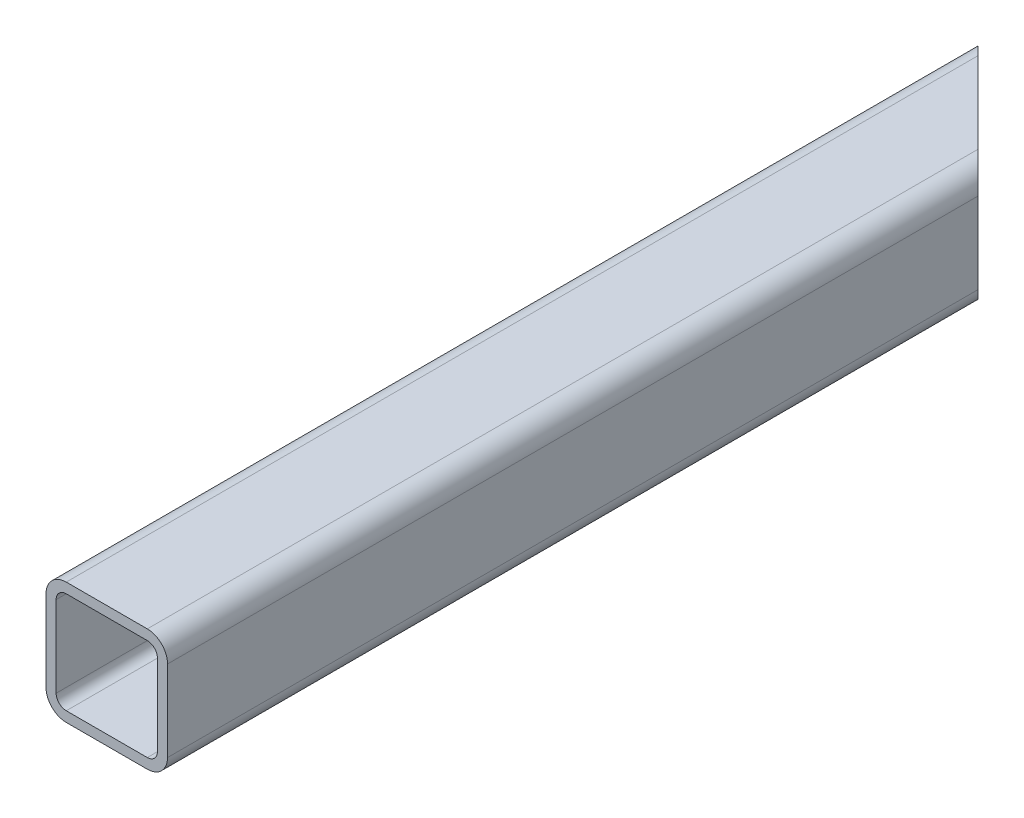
ISO-10303-21;
HEADER;
FILE_DESCRIPTION(('STEP AP214'),'2;1');
FILE_NAME('part.step','',(''),(''),'','','');
FILE_SCHEMA(('AUTOMOTIVE_DESIGN { 1 0 10303 214 1 1 1 1 }'));
ENDSEC;
DATA;
#1=APPLICATION_CONTEXT('core data for automotive mechanical design processes');
#2=APPLICATION_PROTOCOL_DEFINITION('international standard','automotive_design',2000,#1);
#3=PRODUCT_CONTEXT('',#1,'mechanical');
#4=PRODUCT('Part','Part','',(#3));
#5=PRODUCT_RELATED_PRODUCT_CATEGORY('part','',(#4));
#6=PRODUCT_DEFINITION_FORMATION('','',#4);
#7=PRODUCT_DEFINITION_CONTEXT('part definition',#1,'design');
#8=PRODUCT_DEFINITION('design','',#6,#7);
#9=PRODUCT_DEFINITION_SHAPE('','',#8);
#10=(LENGTH_UNIT() NAMED_UNIT(*) SI_UNIT(.MILLI.,.METRE.));
#11=(NAMED_UNIT(*) PLANE_ANGLE_UNIT() SI_UNIT($,.RADIAN.));
#12=(NAMED_UNIT(*) SI_UNIT($,.STERADIAN.) SOLID_ANGLE_UNIT());
#13=UNCERTAINTY_MEASURE_WITH_UNIT(LENGTH_MEASURE(1.E-05),#10,'distance_accuracy_value','');
#14=(GEOMETRIC_REPRESENTATION_CONTEXT(3) GLOBAL_UNCERTAINTY_ASSIGNED_CONTEXT((#13)) GLOBAL_UNIT_ASSIGNED_CONTEXT((#10,
#11,#12)) REPRESENTATION_CONTEXT('',''));
#15=CARTESIAN_POINT('',(0.,0.,0.));
#16=DIRECTION('',(0.,0.,1.));
#17=DIRECTION('',(1.,0.,0.));
#18=AXIS2_PLACEMENT_3D('',#15,#16,#17);
#19=CARTESIAN_POINT('',(20.,20.,460.));
#20=DIRECTION('',(0.,0.,1.));
#21=DIRECTION('',(1.,0.,0.));
#22=AXIS2_PLACEMENT_3D('',#19,#20,#21);
#23=PLANE('',#22);
#24=CARTESIAN_POINT('',(20.,20.,460.));
#25=DIRECTION('',(0.,0.,1.));
#26=DIRECTION('',(1.,0.,0.));
#27=AXIS2_PLACEMENT_3D('',#24,#25,#26);
#28=CIRCLE('',#27,10.);
#29=CARTESIAN_POINT('',(30.,20.,460.));
#30=VERTEX_POINT('',#29);
#31=CARTESIAN_POINT('',(20.,30.,460.));
#32=VERTEX_POINT('',#31);
#33=EDGE_CURVE('E165',#30,#32,#28,.T.);
#34=ORIENTED_EDGE('',*,*,#33,.T.);
#35=DIRECTION('',(-1.,0.,0.));
#36=VECTOR('',#35,1.);
#37=CARTESIAN_POINT('',(20.,30.,460.));
#38=LINE('',#37,#36);
#39=CARTESIAN_POINT('',(-20.,30.,460.));
#40=VERTEX_POINT('',#39);
#41=EDGE_CURVE('E186',#32,#40,#38,.T.);
#42=ORIENTED_EDGE('',*,*,#41,.T.);
#43=CARTESIAN_POINT('',(-20.,20.,460.));
#44=DIRECTION('',(0.,0.,1.));
#45=DIRECTION('',(1.,0.,0.));
#46=AXIS2_PLACEMENT_3D('',#43,#44,#45);
#47=CIRCLE('',#46,10.);
#48=CARTESIAN_POINT('',(-30.,20.,460.));
#49=VERTEX_POINT('',#48);
#50=EDGE_CURVE('E238',#40,#49,#47,.T.);
#51=ORIENTED_EDGE('',*,*,#50,.T.);
#52=DIRECTION('',(0.,-1.,0.));
#53=VECTOR('',#52,1.);
#54=CARTESIAN_POINT('',(-30.,-20.,460.));
#55=LINE('',#54,#53);
#56=CARTESIAN_POINT('',(-30.,-20.,460.));
#57=VERTEX_POINT('',#56);
#58=EDGE_CURVE('E240',#49,#57,#55,.T.);
#59=ORIENTED_EDGE('',*,*,#58,.T.);
#60=CARTESIAN_POINT('',(-20.,-20.,460.));
#61=DIRECTION('',(0.,0.,1.));
#62=DIRECTION('',(1.,0.,0.));
#63=AXIS2_PLACEMENT_3D('',#60,#61,#62);
#64=CIRCLE('',#63,10.);
#65=CARTESIAN_POINT('',(-20.,-30.,460.));
#66=VERTEX_POINT('',#65);
#67=EDGE_CURVE('E169',#57,#66,#64,.T.);
#68=ORIENTED_EDGE('',*,*,#67,.T.);
#69=DIRECTION('',(1.,0.,0.));
#70=VECTOR('',#69,1.);
#71=CARTESIAN_POINT('',(-20.,-30.,460.));
#72=LINE('',#71,#70);
#73=CARTESIAN_POINT('',(20.,-30.,460.));
#74=VERTEX_POINT('',#73);
#75=EDGE_CURVE('E243',#66,#74,#72,.T.);
#76=ORIENTED_EDGE('',*,*,#75,.T.);
#77=CARTESIAN_POINT('',(20.,-20.,460.));
#78=DIRECTION('',(0.,0.,1.));
#79=DIRECTION('',(1.,0.,0.));
#80=AXIS2_PLACEMENT_3D('',#77,#78,#79);
#81=CIRCLE('',#80,10.);
#82=CARTESIAN_POINT('',(30.,-20.,460.));
#83=VERTEX_POINT('',#82);
#84=EDGE_CURVE('E245',#74,#83,#81,.T.);
#85=ORIENTED_EDGE('',*,*,#84,.T.);
#86=DIRECTION('',(0.,1.,0.));
#87=VECTOR('',#86,1.);
#88=CARTESIAN_POINT('',(30.,20.,460.));
#89=LINE('',#88,#87);
#90=EDGE_CURVE('E247',#83,#30,#89,.T.);
#91=ORIENTED_EDGE('',*,*,#90,.T.);
#92=EDGE_LOOP('',(#34,#42,#51,#59,#68,#76,#85,#91));
#93=FACE_BOUND('',#92,.T.);
#94=DIRECTION('',(0.,-1.,0.));
#95=VECTOR('',#94,1.);
#96=CARTESIAN_POINT('',(-25.,-20.,460.));
#97=LINE('',#96,#95);
#98=CARTESIAN_POINT('',(-25.,20.,460.));
#99=VERTEX_POINT('',#98);
#100=CARTESIAN_POINT('',(-25.,-20.,460.));
#101=VERTEX_POINT('',#100);
#102=EDGE_CURVE('E195',#99,#101,#97,.T.);
#103=ORIENTED_EDGE('',*,*,#102,.F.);
#104=CARTESIAN_POINT('',(-20.,20.,460.));
#105=DIRECTION('',(0.,0.,1.));
#106=DIRECTION('',(1.,0.,0.));
#107=AXIS2_PLACEMENT_3D('',#104,#105,#106);
#108=CIRCLE('',#107,5.00000000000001);
#109=CARTESIAN_POINT('',(-20.,25.,460.));
#110=VERTEX_POINT('',#109);
#111=EDGE_CURVE('E193',#110,#99,#108,.T.);
#112=ORIENTED_EDGE('',*,*,#111,.F.);
#113=DIRECTION('',(-1.,0.,0.));
#114=VECTOR('',#113,1.);
#115=CARTESIAN_POINT('',(20.,25.,460.));
#116=LINE('',#115,#114);
#117=CARTESIAN_POINT('',(20.,25.,460.));
#118=VERTEX_POINT('',#117);
#119=EDGE_CURVE('E211',#118,#110,#116,.T.);
#120=ORIENTED_EDGE('',*,*,#119,.F.);
#121=CARTESIAN_POINT('',(20.,20.,460.));
#122=DIRECTION('',(0.,0.,1.));
#123=DIRECTION('',(1.,0.,0.));
#124=AXIS2_PLACEMENT_3D('',#121,#122,#123);
#125=CIRCLE('',#124,5.00000000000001);
#126=CARTESIAN_POINT('',(25.,20.,460.));
#127=VERTEX_POINT('',#126);
#128=EDGE_CURVE('E208',#127,#118,#125,.T.);
#129=ORIENTED_EDGE('',*,*,#128,.F.);
#130=DIRECTION('',(0.,1.,0.));
#131=VECTOR('',#130,1.);
#132=CARTESIAN_POINT('',(25.,20.,460.));
#133=LINE('',#132,#131);
#134=CARTESIAN_POINT('',(25.,-20.,460.));
#135=VERTEX_POINT('',#134);
#136=EDGE_CURVE('E206',#135,#127,#133,.T.);
#137=ORIENTED_EDGE('',*,*,#136,.F.);
#138=CARTESIAN_POINT('',(20.,-20.,460.));
#139=DIRECTION('',(0.,0.,1.));
#140=DIRECTION('',(1.,0.,0.));
#141=AXIS2_PLACEMENT_3D('',#138,#139,#140);
#142=CIRCLE('',#141,5.00000000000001);
#143=CARTESIAN_POINT('',(20.,-25.,460.));
#144=VERTEX_POINT('',#143);
#145=EDGE_CURVE('E204',#144,#135,#142,.T.);
#146=ORIENTED_EDGE('',*,*,#145,.F.);
#147=DIRECTION('',(1.,0.,0.));
#148=VECTOR('',#147,1.);
#149=CARTESIAN_POINT('',(-20.,-25.,460.));
#150=LINE('',#149,#148);
#151=CARTESIAN_POINT('',(-20.,-25.,460.));
#152=VERTEX_POINT('',#151);
#153=EDGE_CURVE('E202',#152,#144,#150,.T.);
#154=ORIENTED_EDGE('',*,*,#153,.F.);
#155=CARTESIAN_POINT('',(-20.,-20.,460.));
#156=DIRECTION('',(0.,0.,1.));
#157=DIRECTION('',(1.,0.,0.));
#158=AXIS2_PLACEMENT_3D('',#155,#156,#157);
#159=CIRCLE('',#158,5.);
#160=EDGE_CURVE('E200',#101,#152,#159,.T.);
#161=ORIENTED_EDGE('',*,*,#160,.F.);
#162=EDGE_LOOP('',(#103,#112,#120,#129,#137,#146,#154,#161));
#163=FACE_BOUND('',#162,.T.);
#164=ADVANCED_FACE('F32',(#93,#163),#23,.T.);
#165=CARTESIAN_POINT('',(20.,20.,460.));
#166=DIRECTION('',(0.,0.,-1.));
#167=DIRECTION('',(-1.,0.,0.));
#168=AXIS2_PLACEMENT_3D('',#165,#166,#167);
#169=CYLINDRICAL_SURFACE('',#168,10.);
#170=DIRECTION('',(0.,0.,-1.));
#171=VECTOR('',#170,1.);
#172=CARTESIAN_POINT('',(30.,20.,460.));
#173=LINE('',#172,#171);
#174=CARTESIAN_POINT('',(30.,20.,60.));
#175=VERTEX_POINT('',#174);
#176=EDGE_CURVE('E192',#30,#175,#173,.T.);
#177=ORIENTED_EDGE('',*,*,#176,.T.);
#178=CARTESIAN_POINT('',(20.,20.,50.));
#179=DIRECTION('',(-0.707106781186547,0.,0.707106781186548));
#180=DIRECTION('',(-0.707106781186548,0.,-0.707106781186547));
#181=AXIS2_PLACEMENT_3D('',#178,#179,#180);
#182=ELLIPSE('',#181,14.1421356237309,10.);
#183=CARTESIAN_POINT('',(20.,30.,50.));
#184=VERTEX_POINT('',#183);
#185=EDGE_CURVE('E47',#175,#184,#182,.T.);
#186=ORIENTED_EDGE('',*,*,#185,.T.);
#187=DIRECTION('',(0.,0.,-1.));
#188=VECTOR('',#187,1.);
#189=CARTESIAN_POINT('',(20.,30.,460.));
#190=LINE('',#189,#188);
#191=EDGE_CURVE('E40',#32,#184,#190,.T.);
#192=ORIENTED_EDGE('',*,*,#191,.F.);
#193=ORIENTED_EDGE('',*,*,#33,.F.);
#194=EDGE_LOOP('',(#177,#186,#192,#193));
#195=FACE_BOUND('',#194,.T.);
#196=ADVANCED_FACE('F34',(#195),#169,.T.);
#197=CARTESIAN_POINT('',(20.,30.,460.));
#198=DIRECTION('',(0.,-1.,0.));
#199=DIRECTION('',(1.,0.,0.));
#200=AXIS2_PLACEMENT_3D('',#197,#198,#199);
#201=PLANE('',#200);
#202=ORIENTED_EDGE('',*,*,#191,.T.);
#203=DIRECTION('',(0.707106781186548,0.,0.707106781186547));
#204=VECTOR('',#203,1.);
#205=CARTESIAN_POINT('',(30.,30.,60.));
#206=LINE('',#205,#204);
#207=CARTESIAN_POINT('',(-20.,30.,10.));
#208=VERTEX_POINT('',#207);
#209=EDGE_CURVE('E185',#208,#184,#206,.T.);
#210=ORIENTED_EDGE('',*,*,#209,.F.);
#211=DIRECTION('',(0.,0.,-1.));
#212=VECTOR('',#211,1.);
#213=CARTESIAN_POINT('',(-20.,30.,460.));
#214=LINE('',#213,#212);
#215=EDGE_CURVE('E172',#40,#208,#214,.T.);
#216=ORIENTED_EDGE('',*,*,#215,.F.);
#217=ORIENTED_EDGE('',*,*,#41,.F.);
#218=EDGE_LOOP('',(#202,#210,#216,#217));
#219=FACE_BOUND('',#218,.T.);
#220=ADVANCED_FACE('F183',(#219),#201,.F.);
#221=CARTESIAN_POINT('',(-20.,20.,460.));
#222=DIRECTION('',(0.,0.,-1.));
#223=DIRECTION('',(-1.,0.,0.));
#224=AXIS2_PLACEMENT_3D('',#221,#222,#223);
#225=CYLINDRICAL_SURFACE('',#224,10.);
#226=ORIENTED_EDGE('',*,*,#215,.T.);
#227=CARTESIAN_POINT('',(-20.,20.,10.));
#228=DIRECTION('',(-0.707106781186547,0.,0.707106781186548));
#229=DIRECTION('',(-0.707106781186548,0.,-0.707106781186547));
#230=AXIS2_PLACEMENT_3D('',#227,#228,#229);
#231=ELLIPSE('',#230,14.1421356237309,10.);
#232=CARTESIAN_POINT('',(-30.,20.,0.));
#233=VERTEX_POINT('',#232);
#234=EDGE_CURVE('E153',#208,#233,#231,.T.);
#235=ORIENTED_EDGE('',*,*,#234,.T.);
#236=DIRECTION('',(0.,0.,-1.));
#237=VECTOR('',#236,1.);
#238=CARTESIAN_POINT('',(-30.,20.,460.));
#239=LINE('',#238,#237);
#240=EDGE_CURVE('E164',#49,#233,#239,.T.);
#241=ORIENTED_EDGE('',*,*,#240,.F.);
#242=ORIENTED_EDGE('',*,*,#50,.F.);
#243=EDGE_LOOP('',(#226,#235,#241,#242));
#244=FACE_BOUND('',#243,.T.);
#245=ADVANCED_FACE('F347',(#244),#225,.T.);
#246=CARTESIAN_POINT('',(-30.,-20.,460.));
#247=DIRECTION('',(1.,0.,0.));
#248=DIRECTION('',(0.,1.,0.));
#249=AXIS2_PLACEMENT_3D('',#246,#247,#248);
#250=PLANE('',#249);
#251=DIRECTION('',(0.,-1.,0.));
#252=VECTOR('',#251,1.);
#253=CARTESIAN_POINT('',(-30.,-20.,0.));
#254=LINE('',#253,#252);
#255=CARTESIAN_POINT('',(-30.,-20.,0.));
#256=VERTEX_POINT('',#255);
#257=EDGE_CURVE('E145',#233,#256,#254,.T.);
#258=ORIENTED_EDGE('',*,*,#257,.T.);
#259=DIRECTION('',(0.,0.,-1.));
#260=VECTOR('',#259,1.);
#261=CARTESIAN_POINT('',(-30.,-20.,460.));
#262=LINE('',#261,#260);
#263=EDGE_CURVE('E161',#57,#256,#262,.T.);
#264=ORIENTED_EDGE('',*,*,#263,.F.);
#265=ORIENTED_EDGE('',*,*,#58,.F.);
#266=ORIENTED_EDGE('',*,*,#240,.T.);
#267=EDGE_LOOP('',(#258,#264,#265,#266));
#268=FACE_BOUND('',#267,.T.);
#269=ADVANCED_FACE('F159',(#268),#250,.F.);
#270=CARTESIAN_POINT('',(-20.,-20.,460.));
#271=DIRECTION('',(0.,0.,-1.));
#272=DIRECTION('',(-1.,0.,0.));
#273=AXIS2_PLACEMENT_3D('',#270,#271,#272);
#274=CYLINDRICAL_SURFACE('',#273,10.);
#275=ORIENTED_EDGE('',*,*,#263,.T.);
#276=CARTESIAN_POINT('',(-20.,-20.,10.));
#277=DIRECTION('',(-0.707106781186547,0.,0.707106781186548));
#278=DIRECTION('',(-0.707106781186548,0.,-0.707106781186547));
#279=AXIS2_PLACEMENT_3D('',#276,#277,#278);
#280=ELLIPSE('',#279,14.1421356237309,10.);
#281=CARTESIAN_POINT('',(-20.,-30.,10.));
#282=VERTEX_POINT('',#281);
#283=EDGE_CURVE('E142',#256,#282,#280,.T.);
#284=ORIENTED_EDGE('',*,*,#283,.T.);
#285=DIRECTION('',(0.,0.,-1.));
#286=VECTOR('',#285,1.);
#287=CARTESIAN_POINT('',(-20.,-30.,460.));
#288=LINE('',#287,#286);
#289=EDGE_CURVE('E170',#66,#282,#288,.T.);
#290=ORIENTED_EDGE('',*,*,#289,.F.);
#291=ORIENTED_EDGE('',*,*,#67,.F.);
#292=EDGE_LOOP('',(#275,#284,#290,#291));
#293=FACE_BOUND('',#292,.T.);
#294=ADVANCED_FACE('F168',(#293),#274,.T.);
#295=CARTESIAN_POINT('',(-20.,-30.,460.));
#296=DIRECTION('',(0.,1.,0.));
#297=DIRECTION('',(-1.,0.,0.));
#298=AXIS2_PLACEMENT_3D('',#295,#296,#297);
#299=PLANE('',#298);
#300=ORIENTED_EDGE('',*,*,#289,.T.);
#301=DIRECTION('',(0.707106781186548,0.,0.707106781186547));
#302=VECTOR('',#301,1.);
#303=CARTESIAN_POINT('',(30.,-30.,60.));
#304=LINE('',#303,#302);
#305=CARTESIAN_POINT('',(20.,-30.,50.));
#306=VERTEX_POINT('',#305);
#307=EDGE_CURVE('E148',#282,#306,#304,.T.);
#308=ORIENTED_EDGE('',*,*,#307,.T.);
#309=DIRECTION('',(0.,0.,-1.));
#310=VECTOR('',#309,1.);
#311=CARTESIAN_POINT('',(20.,-30.,460.));
#312=LINE('',#311,#310);
#313=EDGE_CURVE('E174',#74,#306,#312,.T.);
#314=ORIENTED_EDGE('',*,*,#313,.F.);
#315=ORIENTED_EDGE('',*,*,#75,.F.);
#316=EDGE_LOOP('',(#300,#308,#314,#315));
#317=FACE_BOUND('',#316,.T.);
#318=ADVANCED_FACE('F261',(#317),#299,.F.);
#319=CARTESIAN_POINT('',(20.,-20.,460.));
#320=DIRECTION('',(0.,0.,-1.));
#321=DIRECTION('',(-1.,0.,0.));
#322=AXIS2_PLACEMENT_3D('',#319,#320,#321);
#323=CYLINDRICAL_SURFACE('',#322,10.);
#324=ORIENTED_EDGE('',*,*,#313,.T.);
#325=CARTESIAN_POINT('',(20.,-20.,50.));
#326=DIRECTION('',(-0.707106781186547,0.,0.707106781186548));
#327=DIRECTION('',(-0.707106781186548,0.,-0.707106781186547));
#328=AXIS2_PLACEMENT_3D('',#325,#326,#327);
#329=ELLIPSE('',#328,14.1421356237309,10.);
#330=CARTESIAN_POINT('',(30.,-20.,60.));
#331=VERTEX_POINT('',#330);
#332=EDGE_CURVE('E154',#306,#331,#329,.T.);
#333=ORIENTED_EDGE('',*,*,#332,.T.);
#334=DIRECTION('',(0.,0.,-1.));
#335=VECTOR('',#334,1.);
#336=CARTESIAN_POINT('',(30.,-20.,460.));
#337=LINE('',#336,#335);
#338=EDGE_CURVE('E250',#83,#331,#337,.T.);
#339=ORIENTED_EDGE('',*,*,#338,.F.);
#340=ORIENTED_EDGE('',*,*,#84,.F.);
#341=EDGE_LOOP('',(#324,#333,#339,#340));
#342=FACE_BOUND('',#341,.T.);
#343=ADVANCED_FACE('F257',(#342),#323,.T.);
#344=CARTESIAN_POINT('',(30.,20.,460.));
#345=DIRECTION('',(-1.,0.,0.));
#346=DIRECTION('',(0.,0.,1.));
#347=AXIS2_PLACEMENT_3D('',#344,#345,#346);
#348=PLANE('',#347);
#349=ORIENTED_EDGE('',*,*,#338,.T.);
#350=DIRECTION('',(0.,1.,0.));
#351=VECTOR('',#350,1.);
#352=CARTESIAN_POINT('',(30.,-30.,60.));
#353=LINE('',#352,#351);
#354=EDGE_CURVE('E262',#331,#175,#353,.T.);
#355=ORIENTED_EDGE('',*,*,#354,.T.);
#356=ORIENTED_EDGE('',*,*,#176,.F.);
#357=ORIENTED_EDGE('',*,*,#90,.F.);
#358=EDGE_LOOP('',(#349,#355,#356,#357));
#359=FACE_BOUND('',#358,.T.);
#360=ADVANCED_FACE('F335',(#359),#348,.F.);
#361=CARTESIAN_POINT('',(-20.,20.,460.));
#362=DIRECTION('',(0.,0.,-1.));
#363=DIRECTION('',(-1.,0.,0.));
#364=AXIS2_PLACEMENT_3D('',#361,#362,#363);
#365=CYLINDRICAL_SURFACE('',#364,5.00000000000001);
#366=CARTESIAN_POINT('',(-20.,20.,10.));
#367=DIRECTION('',(-0.707106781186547,0.,0.707106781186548));
#368=DIRECTION('',(-0.707106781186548,0.,-0.707106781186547));
#369=AXIS2_PLACEMENT_3D('',#366,#367,#368);
#370=ELLIPSE('',#369,7.07106781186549,5.00000000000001);
#371=CARTESIAN_POINT('',(-20.,25.,9.99999999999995));
#372=VERTEX_POINT('',#371);
#373=CARTESIAN_POINT('',(-25.,20.,4.99999999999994));
#374=VERTEX_POINT('',#373);
#375=EDGE_CURVE('E278',#372,#374,#370,.T.);
#376=ORIENTED_EDGE('',*,*,#375,.F.);
#377=DIRECTION('',(0.,0.,-1.));
#378=VECTOR('',#377,1.);
#379=CARTESIAN_POINT('',(-20.,25.,460.));
#380=LINE('',#379,#378);
#381=EDGE_CURVE('E213',#110,#372,#380,.T.);
#382=ORIENTED_EDGE('',*,*,#381,.F.);
#383=ORIENTED_EDGE('',*,*,#111,.T.);
#384=DIRECTION('',(0.,0.,-1.));
#385=VECTOR('',#384,1.);
#386=CARTESIAN_POINT('',(-25.,20.,460.));
#387=LINE('',#386,#385);
#388=EDGE_CURVE('E166',#99,#374,#387,.T.);
#389=ORIENTED_EDGE('',*,*,#388,.T.);
#390=EDGE_LOOP('',(#376,#382,#383,#389));
#391=FACE_BOUND('',#390,.T.);
#392=ADVANCED_FACE('F290',(#391),#365,.F.);
#393=CARTESIAN_POINT('',(-25.,-20.,460.));
#394=DIRECTION('',(1.,0.,0.));
#395=DIRECTION('',(0.,1.,0.));
#396=AXIS2_PLACEMENT_3D('',#393,#394,#395);
#397=PLANE('',#396);
#398=DIRECTION('',(0.,-1.,0.));
#399=VECTOR('',#398,1.);
#400=CARTESIAN_POINT('',(-25.,-20.0000000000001,4.99999999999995));
#401=LINE('',#400,#399);
#402=CARTESIAN_POINT('',(-25.,-20.,4.99999999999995));
#403=VERTEX_POINT('',#402);
#404=EDGE_CURVE('E276',#374,#403,#401,.T.);
#405=ORIENTED_EDGE('',*,*,#404,.F.);
#406=ORIENTED_EDGE('',*,*,#388,.F.);
#407=ORIENTED_EDGE('',*,*,#102,.T.);
#408=DIRECTION('',(0.,0.,-1.));
#409=VECTOR('',#408,1.);
#410=CARTESIAN_POINT('',(-25.,-20.,460.));
#411=LINE('',#410,#409);
#412=EDGE_CURVE('E231',#101,#403,#411,.T.);
#413=ORIENTED_EDGE('',*,*,#412,.T.);
#414=EDGE_LOOP('',(#405,#406,#407,#413));
#415=FACE_BOUND('',#414,.T.);
#416=ADVANCED_FACE('F287',(#415),#397,.T.);
#417=CARTESIAN_POINT('',(-20.,-20.,460.));
#418=DIRECTION('',(0.,0.,-1.));
#419=DIRECTION('',(-1.,0.,0.));
#420=AXIS2_PLACEMENT_3D('',#417,#418,#419);
#421=CYLINDRICAL_SURFACE('',#420,5.);
#422=CARTESIAN_POINT('',(-20.,-20.,10.));
#423=DIRECTION('',(-0.707106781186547,0.,0.707106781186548));
#424=DIRECTION('',(-0.707106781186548,0.,-0.707106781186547));
#425=AXIS2_PLACEMENT_3D('',#422,#423,#424);
#426=ELLIPSE('',#425,7.07106781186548,5.);
#427=CARTESIAN_POINT('',(-20.,-25.,10.));
#428=VERTEX_POINT('',#427);
#429=EDGE_CURVE('E274',#403,#428,#426,.T.);
#430=ORIENTED_EDGE('',*,*,#429,.F.);
#431=ORIENTED_EDGE('',*,*,#412,.F.);
#432=ORIENTED_EDGE('',*,*,#160,.T.);
#433=DIRECTION('',(0.,0.,-1.));
#434=VECTOR('',#433,1.);
#435=CARTESIAN_POINT('',(-20.,-25.,460.));
#436=LINE('',#435,#434);
#437=EDGE_CURVE('E228',#152,#428,#436,.T.);
#438=ORIENTED_EDGE('',*,*,#437,.T.);
#439=EDGE_LOOP('',(#430,#431,#432,#438));
#440=FACE_BOUND('',#439,.T.);
#441=ADVANCED_FACE('F298',(#440),#421,.F.);
#442=CARTESIAN_POINT('',(-20.,-25.,460.));
#443=DIRECTION('',(0.,1.,0.));
#444=DIRECTION('',(-1.,0.,0.));
#445=AXIS2_PLACEMENT_3D('',#442,#443,#444);
#446=PLANE('',#445);
#447=DIRECTION('',(0.707106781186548,0.,0.707106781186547));
#448=VECTOR('',#447,1.);
#449=CARTESIAN_POINT('',(205.,-25.,235.));
#450=LINE('',#449,#448);
#451=CARTESIAN_POINT('',(20.,-25.,50.));
#452=VERTEX_POINT('',#451);
#453=EDGE_CURVE('E272',#428,#452,#450,.T.);
#454=ORIENTED_EDGE('',*,*,#453,.F.);
#455=ORIENTED_EDGE('',*,*,#437,.F.);
#456=ORIENTED_EDGE('',*,*,#153,.T.);
#457=DIRECTION('',(0.,0.,-1.));
#458=VECTOR('',#457,1.);
#459=CARTESIAN_POINT('',(20.,-25.,460.));
#460=LINE('',#459,#458);
#461=EDGE_CURVE('E225',#144,#452,#460,.T.);
#462=ORIENTED_EDGE('',*,*,#461,.T.);
#463=EDGE_LOOP('',(#454,#455,#456,#462));
#464=FACE_BOUND('',#463,.T.);
#465=ADVANCED_FACE('F303',(#464),#446,.T.);
#466=CARTESIAN_POINT('',(20.,-20.,460.));
#467=DIRECTION('',(0.,0.,-1.));
#468=DIRECTION('',(-1.,0.,0.));
#469=AXIS2_PLACEMENT_3D('',#466,#467,#468);
#470=CYLINDRICAL_SURFACE('',#469,5.00000000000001);
#471=CARTESIAN_POINT('',(20.,-20.,50.));
#472=DIRECTION('',(-0.707106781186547,0.,0.707106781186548));
#473=DIRECTION('',(-0.707106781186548,0.,-0.707106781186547));
#474=AXIS2_PLACEMENT_3D('',#471,#472,#473);
#475=ELLIPSE('',#474,7.07106781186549,5.00000000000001);
#476=CARTESIAN_POINT('',(25.,-20.,54.9999999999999));
#477=VERTEX_POINT('',#476);
#478=EDGE_CURVE('E270',#452,#477,#475,.T.);
#479=ORIENTED_EDGE('',*,*,#478,.F.);
#480=ORIENTED_EDGE('',*,*,#461,.F.);
#481=ORIENTED_EDGE('',*,*,#145,.T.);
#482=DIRECTION('',(0.,0.,-1.));
#483=VECTOR('',#482,1.);
#484=CARTESIAN_POINT('',(25.,-20.,460.));
#485=LINE('',#484,#483);
#486=EDGE_CURVE('E222',#135,#477,#485,.T.);
#487=ORIENTED_EDGE('',*,*,#486,.T.);
#488=EDGE_LOOP('',(#479,#480,#481,#487));
#489=FACE_BOUND('',#488,.T.);
#490=ADVANCED_FACE('F307',(#489),#470,.F.);
#491=CARTESIAN_POINT('',(25.,20.,460.));
#492=DIRECTION('',(-1.,0.,0.));
#493=DIRECTION('',(0.,0.,1.));
#494=AXIS2_PLACEMENT_3D('',#491,#492,#493);
#495=PLANE('',#494);
#496=DIRECTION('',(0.,1.,0.));
#497=VECTOR('',#496,1.);
#498=CARTESIAN_POINT('',(25.,20.,54.9999999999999));
#499=LINE('',#498,#497);
#500=CARTESIAN_POINT('',(25.,20.,55.));
#501=VERTEX_POINT('',#500);
#502=EDGE_CURVE('E268',#477,#501,#499,.T.);
#503=ORIENTED_EDGE('',*,*,#502,.F.);
#504=ORIENTED_EDGE('',*,*,#486,.F.);
#505=ORIENTED_EDGE('',*,*,#136,.T.);
#506=DIRECTION('',(0.,0.,-1.));
#507=VECTOR('',#506,1.);
#508=CARTESIAN_POINT('',(25.,20.,460.));
#509=LINE('',#508,#507);
#510=EDGE_CURVE('E219',#127,#501,#509,.T.);
#511=ORIENTED_EDGE('',*,*,#510,.T.);
#512=EDGE_LOOP('',(#503,#504,#505,#511));
#513=FACE_BOUND('',#512,.T.);
#514=ADVANCED_FACE('F313',(#513),#495,.T.);
#515=CARTESIAN_POINT('',(20.,20.,460.));
#516=DIRECTION('',(0.,0.,-1.));
#517=DIRECTION('',(-1.,0.,0.));
#518=AXIS2_PLACEMENT_3D('',#515,#516,#517);
#519=CYLINDRICAL_SURFACE('',#518,5.00000000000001);
#520=CARTESIAN_POINT('',(20.,20.,50.));
#521=DIRECTION('',(-0.707106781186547,0.,0.707106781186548));
#522=DIRECTION('',(-0.707106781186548,0.,-0.707106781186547));
#523=AXIS2_PLACEMENT_3D('',#520,#521,#522);
#524=ELLIPSE('',#523,7.07106781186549,5.00000000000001);
#525=CARTESIAN_POINT('',(20.,25.,49.9999999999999));
#526=VERTEX_POINT('',#525);
#527=EDGE_CURVE('E54',#501,#526,#524,.T.);
#528=ORIENTED_EDGE('',*,*,#527,.F.);
#529=ORIENTED_EDGE('',*,*,#510,.F.);
#530=ORIENTED_EDGE('',*,*,#128,.T.);
#531=DIRECTION('',(0.,0.,-1.));
#532=VECTOR('',#531,1.);
#533=CARTESIAN_POINT('',(20.,25.,460.));
#534=LINE('',#533,#532);
#535=EDGE_CURVE('E216',#118,#526,#534,.T.);
#536=ORIENTED_EDGE('',*,*,#535,.T.);
#537=EDGE_LOOP('',(#528,#529,#530,#536));
#538=FACE_BOUND('',#537,.T.);
#539=ADVANCED_FACE('F315',(#538),#519,.F.);
#540=CARTESIAN_POINT('',(20.,25.,460.));
#541=DIRECTION('',(0.,-1.,0.));
#542=DIRECTION('',(1.,0.,0.));
#543=AXIS2_PLACEMENT_3D('',#540,#541,#542);
#544=PLANE('',#543);
#545=DIRECTION('',(-0.707106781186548,0.,-0.707106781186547));
#546=VECTOR('',#545,1.);
#547=CARTESIAN_POINT('',(225.,25.,255.));
#548=LINE('',#547,#546);
#549=EDGE_CURVE('E11',#526,#372,#548,.T.);
#550=ORIENTED_EDGE('',*,*,#549,.F.);
#551=ORIENTED_EDGE('',*,*,#535,.F.);
#552=ORIENTED_EDGE('',*,*,#119,.T.);
#553=ORIENTED_EDGE('',*,*,#381,.T.);
#554=EDGE_LOOP('',(#550,#551,#552,#553));
#555=FACE_BOUND('',#554,.T.);
#556=ADVANCED_FACE('F317',(#555),#544,.T.);
#557=CARTESIAN_POINT('',(30.,-30.,60.));
#558=DIRECTION('',(-0.707106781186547,0.,0.707106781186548));
#559=DIRECTION('',(0.707106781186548,0.,0.707106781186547));
#560=AXIS2_PLACEMENT_3D('',#557,#558,#559);
#561=PLANE('',#560);
#562=ORIENTED_EDGE('',*,*,#375,.T.);
#563=ORIENTED_EDGE('',*,*,#404,.T.);
#564=ORIENTED_EDGE('',*,*,#429,.T.);
#565=ORIENTED_EDGE('',*,*,#453,.T.);
#566=ORIENTED_EDGE('',*,*,#478,.T.);
#567=ORIENTED_EDGE('',*,*,#502,.T.);
#568=ORIENTED_EDGE('',*,*,#527,.T.);
#569=ORIENTED_EDGE('',*,*,#549,.T.);
#570=EDGE_LOOP('',(#562,#563,#564,#565,#566,#567,#568,#569));
#571=FACE_BOUND('',#570,.T.);
#572=ORIENTED_EDGE('',*,*,#354,.F.);
#573=ORIENTED_EDGE('',*,*,#332,.F.);
#574=ORIENTED_EDGE('',*,*,#307,.F.);
#575=ORIENTED_EDGE('',*,*,#283,.F.);
#576=ORIENTED_EDGE('',*,*,#257,.F.);
#577=ORIENTED_EDGE('',*,*,#234,.F.);
#578=ORIENTED_EDGE('',*,*,#209,.T.);
#579=ORIENTED_EDGE('',*,*,#185,.F.);
#580=EDGE_LOOP('',(#572,#573,#574,#575,#576,#577,#578,#579));
#581=FACE_BOUND('',#580,.T.);
#582=ADVANCED_FACE('F144',(#571,#581),#561,.F.);
#583=CLOSED_SHELL('',(#164,#196,#220,#245,#269,#294,#318,#343,#360,#392,#416,#441,#465,#490,
#514,#539,#556,#582));
#584=MANIFOLD_SOLID_BREP('B2',#583);
#585=ADVANCED_BREP_SHAPE_REPRESENTATION('',(#18,#584),#14);
#586=SHAPE_DEFINITION_REPRESENTATION(#9,#585);
ENDSEC;
END-ISO-10303-21;
